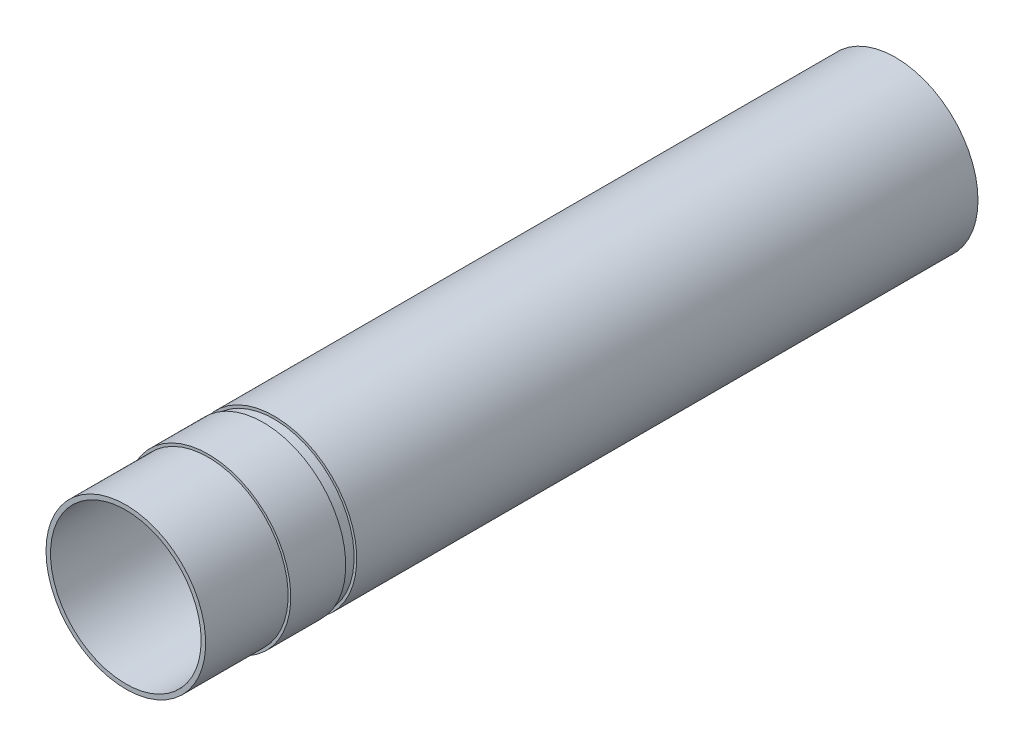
from build123d import *

# Parameters (mm, degrees)
BOSS_EXTRUDE1_DEPTH      = 88.9
BOSS_EXTRUDE1_DEPTH_BACK = 88.9
SKETCH3_R                = 19.05
SKETCH3_R_2              = 17.399
SKETCH6_W                = 2.54
SKETCH6_H                = 0.6096
SKETCH6_W_2              = 19.05
SKETCH6_H_2              = 18.2626


with BuildPart() as part:
    # Sketch3 → Boss-Extrude1 (new, two sides: drawn at the far end of the back side and taken through both)
    with BuildSketch(Plane.XY.offset(-BOSS_EXTRUDE1_DEPTH_BACK)):
        Circle(SKETCH3_R)
        Circle(SKETCH3_R_2, mode=Mode.SUBTRACT)
    extrude(amount=BOSS_EXTRUDE1_DEPTH + BOSS_EXTRUDE1_DEPTH_BACK)

    # Sketch6 → Cut-Revolve1 (revolve, cut)
    with BuildSketch(Plane(origin=(0, 0, 0), x_dir=(0, 0, -1), z_dir=(1, 0, 0)), mode=Mode.PRIVATE) as cut_revolve1_sk:
        with Locations((-55.88, 18.7452)):
            Rectangle(SKETCH6_W, SKETCH6_H)
        with Locations((-79.375, 18.7452)):
            Rectangle(SKETCH6_W_2, SKETCH6_H)
        with Locations((49.53, 9.1313)):
            Rectangle(SKETCH6_W, SKETCH6_H_2)
    revolve(cut_revolve1_sk.sketch.rotate(Axis((0, 0, 0), (0, 0, 1)), 90), axis=Axis((0, 0, 0), (0, 0, 1)), mode=Mode.SUBTRACT)


solid = part.part
